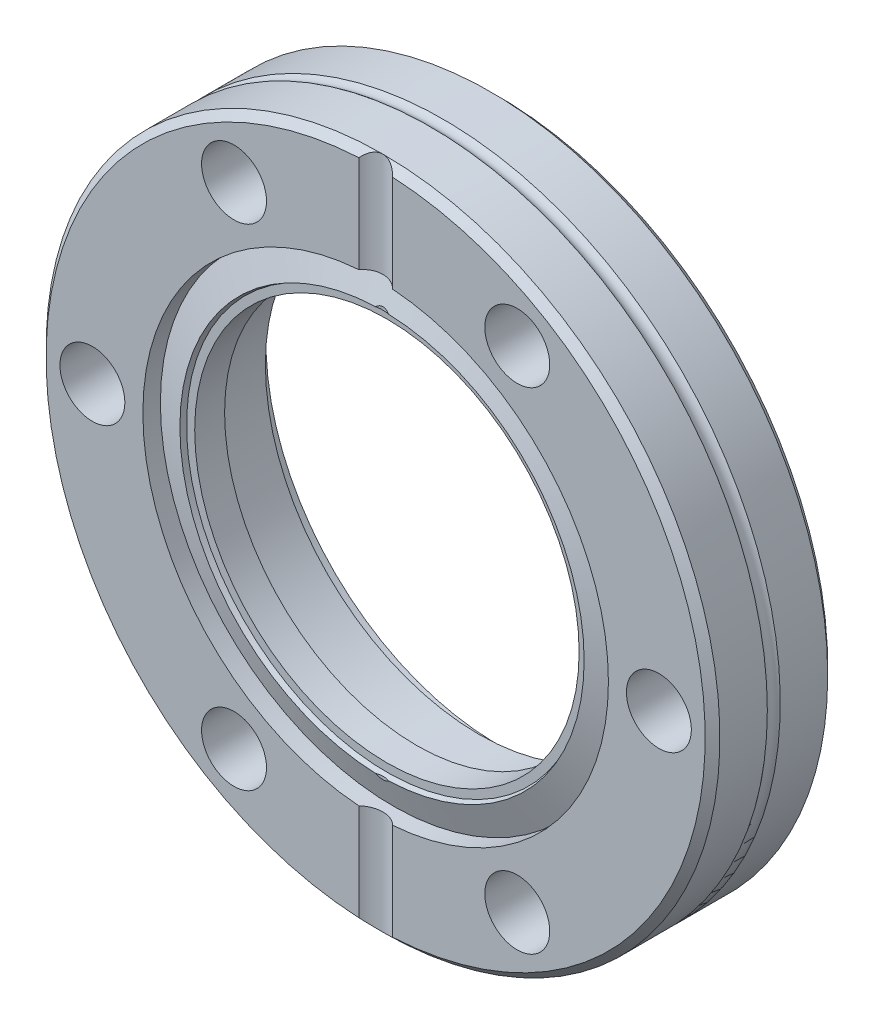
ISO-10303-21;
HEADER;
FILE_DESCRIPTION(('STEP AP214'),'2;1');
FILE_NAME('part.step','',(''),(''),'','','');
FILE_SCHEMA(('AUTOMOTIVE_DESIGN { 1 0 10303 214 1 1 1 1 }'));
ENDSEC;
DATA;
#1=APPLICATION_CONTEXT('core data for automotive mechanical design processes');
#2=APPLICATION_PROTOCOL_DEFINITION('international standard','automotive_design',2000,#1);
#3=PRODUCT_CONTEXT('',#1,'mechanical');
#4=PRODUCT('Part','Part','',(#3));
#5=PRODUCT_RELATED_PRODUCT_CATEGORY('part','',(#4));
#6=PRODUCT_DEFINITION_FORMATION('','',#4);
#7=PRODUCT_DEFINITION_CONTEXT('part definition',#1,'design');
#8=PRODUCT_DEFINITION('design','',#6,#7);
#9=PRODUCT_DEFINITION_SHAPE('','',#8);
#10=(LENGTH_UNIT() NAMED_UNIT(*) SI_UNIT(.MILLI.,.METRE.));
#11=(NAMED_UNIT(*) PLANE_ANGLE_UNIT() SI_UNIT($,.RADIAN.));
#12=(NAMED_UNIT(*) SI_UNIT($,.STERADIAN.) SOLID_ANGLE_UNIT());
#13=UNCERTAINTY_MEASURE_WITH_UNIT(LENGTH_MEASURE(1.E-05),#10,'distance_accuracy_value','');
#14=(GEOMETRIC_REPRESENTATION_CONTEXT(3) GLOBAL_UNCERTAINTY_ASSIGNED_CONTEXT((#13)) GLOBAL_UNIT_ASSIGNED_CONTEXT((#10,
#11,#12)) REPRESENTATION_CONTEXT('',''));
#15=CARTESIAN_POINT('',(0.,0.,0.));
#16=DIRECTION('',(0.,0.,1.));
#17=DIRECTION('',(1.,0.,0.));
#18=AXIS2_PLACEMENT_3D('',#15,#16,#17);
#19=CARTESIAN_POINT('',(0.,0.,11.5316));
#20=DIRECTION('',(0.,0.,1.));
#21=DIRECTION('',(1.,0.,0.));
#22=AXIS2_PLACEMENT_3D('',#19,#20,#21);
#23=PLANE('',#22);
#24=CARTESIAN_POINT('',(0.,0.,11.5316));
#25=DIRECTION('',(0.,0.,1.));
#26=DIRECTION('',(1.,0.,0.));
#27=AXIS2_PLACEMENT_3D('',#24,#25,#26);
#28=CIRCLE('',#27,20.7701031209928);
#29=CARTESIAN_POINT('',(20.7701031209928,0.,11.5316));
#30=VERTEX_POINT('',#29);
#31=EDGE_CURVE('E83',#30,#30,#28,.T.);
#32=ORIENTED_EDGE('',*,*,#31,.T.);
#33=EDGE_LOOP('',(#32));
#34=FACE_BOUND('',#33,.T.);
#35=CARTESIAN_POINT('',(0.,0.,11.5316));
#36=DIRECTION('',(0.,0.,1.));
#37=DIRECTION('',(1.,0.,0.));
#38=AXIS2_PLACEMENT_3D('',#35,#36,#37);
#39=CIRCLE('',#38,19.9263);
#40=CARTESIAN_POINT('',(19.9263,0.,11.5316));
#41=VERTEX_POINT('',#40);
#42=EDGE_CURVE('E23',#41,#41,#39,.F.);
#43=ORIENTED_EDGE('',*,*,#42,.T.);
#44=EDGE_LOOP('',(#43));
#45=FACE_BOUND('',#44,.T.);
#46=ADVANCED_FACE('F19',(#34,#45),#23,.T.);
#47=CARTESIAN_POINT('',(0.,0.,101.848632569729));
#48=DIRECTION('',(0.,0.,1.));
#49=DIRECTION('',(1.,0.,0.));
#50=AXIS2_PLACEMENT_3D('',#47,#48,#49);
#51=CYLINDRICAL_SURFACE('',#50,19.9263);
#52=ORIENTED_EDGE('',*,*,#42,.F.);
#53=EDGE_LOOP('',(#52));
#54=FACE_BOUND('',#53,.T.);
#55=CARTESIAN_POINT('',(0.,0.,8.4328));
#56=DIRECTION('',(0.,0.,1.));
#57=DIRECTION('',(1.,0.,0.));
#58=AXIS2_PLACEMENT_3D('',#55,#56,#57);
#59=CIRCLE('',#58,19.9263);
#60=CARTESIAN_POINT('',(19.9263,0.,8.4328));
#61=VERTEX_POINT('',#60);
#62=EDGE_CURVE('E87',#61,#61,#59,.F.);
#63=ORIENTED_EDGE('',*,*,#62,.T.);
#64=EDGE_LOOP('',(#63));
#65=FACE_BOUND('',#64,.T.);
#66=ADVANCED_FACE('F444',(#54,#65),#51,.F.);
#67=CARTESIAN_POINT('',(0.,-275.59,14.32052));
#68=DIRECTION('',(0.,-1.,0.));
#69=DIRECTION('',(0.,0.,-1.));
#70=AXIS2_PLACEMENT_3D('',#67,#68,#69);
#71=CYLINDRICAL_SURFACE('',#70,2.38125);
#72=CARTESIAN_POINT('',(0.683926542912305,-20.943836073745,12.0396));
#73=CARTESIAN_POINT('',(0.628023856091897,-20.939558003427,12.0228364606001));
#74=CARTESIAN_POINT('',(0.571484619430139,-20.9358233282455,12.0081255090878));
#75=CARTESIAN_POINT('',(0.457421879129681,-20.9294373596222,11.9828867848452));
#76=CARTESIAN_POINT('',(0.399898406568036,-20.9267860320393,11.9723588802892));
#77=CARTESIAN_POINT('',(0.228907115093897,-20.920547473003,11.9475466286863));
#78=CARTESIAN_POINT('',(0.114453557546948,-20.9184828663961,11.93927));
#79=CARTESIAN_POINT('',(-0.114453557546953,-20.9184828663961,11.93927));
#80=CARTESIAN_POINT('',(-0.228907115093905,-20.920547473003,11.9475466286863));
#81=CARTESIAN_POINT('',(-0.399898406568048,-20.9267860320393,11.9723588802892));
#82=CARTESIAN_POINT('',(-0.457421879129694,-20.9294373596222,11.9828867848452));
#83=CARTESIAN_POINT('',(-0.571484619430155,-20.9358233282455,12.0081255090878));
#84=CARTESIAN_POINT('',(-0.628023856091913,-20.939558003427,12.0228364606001));
#85=CARTESIAN_POINT('',(-0.683926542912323,-20.943836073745,12.0396));
#86=B_SPLINE_CURVE_WITH_KNOTS('',3,(#72,#73,#74,#75,#76,#77,#78,#79,#80,#81,#82,#83,#84,#85),
.UNSPECIFIED.,.F.,.F.,(4,2,2,2,2,2,4),(0.,0.1754746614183,0.35094379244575,0.693915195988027,
1.03688659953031,1.21235573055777,1.38783039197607),.UNSPECIFIED.);
#87=CARTESIAN_POINT('',(0.683926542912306,-20.943836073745,12.0396));
#88=VERTEX_POINT('',#87);
#89=CARTESIAN_POINT('',(-0.68392654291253,-20.9438360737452,12.0395999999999));
#90=VERTEX_POINT('',#89);
#91=EDGE_CURVE('E76',#88,#90,#86,.T.);
#92=ORIENTED_EDGE('',*,*,#91,.T.);
#93=CARTESIAN_POINT('',(0.683926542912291,-20.943836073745,12.0396));
#94=CARTESIAN_POINT('',(0.640692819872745,-20.9808495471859,12.0266484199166));
#95=CARTESIAN_POINT('',(0.595267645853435,-21.0159808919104,12.0143571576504));
#96=CARTESIAN_POINT('',(0.499356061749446,-21.0807898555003,11.9916848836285));
#97=CARTESIAN_POINT('',(0.448809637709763,-21.1103875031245,11.9813318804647));
#98=CARTESIAN_POINT('',(0.351405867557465,-21.1573400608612,11.9649094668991));
#99=CARTESIAN_POINT('',(0.3052083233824,-21.175885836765,11.9584233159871));
#100=CARTESIAN_POINT('',(0.210389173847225,-21.2053793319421,11.9481087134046));
#101=CARTESIAN_POINT('',(0.1617850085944,-21.2163750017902,11.9442634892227));
#102=CARTESIAN_POINT('',(0.0939429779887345,-21.2255644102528,11.9410499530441));
#103=CARTESIAN_POINT('',(0.0752230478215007,-21.2274674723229,11.9403844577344));
#104=CARTESIAN_POINT('',(0.0376720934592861,-21.2300143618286,11.9394938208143));
#105=CARTESIAN_POINT('',(0.0188409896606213,-21.2306571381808,11.9392690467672));
#106=CARTESIAN_POINT('',(-0.0476785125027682,-21.2306475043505,11.9392724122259));
#107=CARTESIAN_POINT('',(-0.0954203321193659,-21.2265069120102,11.9407203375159));
#108=CARTESIAN_POINT('',(-0.18943115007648,-21.2104200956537,11.9463459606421));
#109=CARTESIAN_POINT('',(-0.235696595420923,-21.19845634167,11.9505297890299));
#110=CARTESIAN_POINT('',(-0.338159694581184,-21.1636764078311,11.9626933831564));
#111=CARTESIAN_POINT('',(-0.393552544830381,-21.1387704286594,11.9714041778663));
#112=CARTESIAN_POINT('',(-0.499412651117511,-21.0810328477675,11.9915999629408));
#113=CARTESIAN_POINT('',(-0.549871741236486,-21.0481884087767,12.0030894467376));
#114=CARTESIAN_POINT('',(-0.627498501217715,-20.9906039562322,12.0232359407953));
#115=CARTESIAN_POINT('',(-0.656144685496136,-20.967622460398,12.0312768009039));
#116=CARTESIAN_POINT('',(-0.683926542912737,-20.9438360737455,12.0395999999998));
#117=B_SPLINE_CURVE_WITH_KNOTS('',3,(#93,#94,#95,#96,#97,#98,#99,#100,#101,#102,#103,#104,#105,
#106,#107,#108,#109,#110,#111,#112,#113,#114,#115,#116),.UNSPECIFIED.,.F.,.F.,(4,2,2,2,2,2,2,2,
2,2,2,4),(0.,0.175480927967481,0.35332929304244,0.503356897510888,0.652422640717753,
0.708867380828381,0.765359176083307,0.908315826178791,1.05159391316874,1.23461585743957,
1.41793577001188,1.53056719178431),.UNSPECIFIED.);
#118=EDGE_CURVE('E84',#88,#90,#117,.T.);
#119=ORIENTED_EDGE('',*,*,#118,.F.);
#120=EDGE_LOOP('',(#92,#119));
#121=FACE_BOUND('',#120,.T.);
#122=ADVANCED_FACE('F85',(#121),#71,.F.);
#123=CARTESIAN_POINT('',(0.,0.,12.0396));
#124=DIRECTION('',(0.,0.,1.));
#125=DIRECTION('',(1.,0.,0.));
#126=AXIS2_PLACEMENT_3D('',#123,#124,#125);
#127=CONICAL_SURFACE('',#126,20.955,0.349065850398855);
#128=ORIENTED_EDGE('',*,*,#91,.F.);
#129=CARTESIAN_POINT('',(0.,0.,12.0396));
#130=DIRECTION('',(0.,0.,-1.));
#131=DIRECTION('',(-1.,0.,0.));
#132=AXIS2_PLACEMENT_3D('',#129,#130,#131);
#133=CIRCLE('',#132,20.955);
#134=CARTESIAN_POINT('',(0.683926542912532,20.9438360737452,12.0395999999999));
#135=VERTEX_POINT('',#134);
#136=EDGE_CURVE('E81',#135,#88,#133,.T.);
#137=ORIENTED_EDGE('',*,*,#136,.F.);
#138=CARTESIAN_POINT('',(0.683926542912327,20.943836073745,12.0396));
#139=CARTESIAN_POINT('',(0.628023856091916,20.939558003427,12.0228364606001));
#140=CARTESIAN_POINT('',(0.571484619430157,20.9358233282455,12.0081255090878));
#141=CARTESIAN_POINT('',(0.457421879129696,20.9294373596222,11.9828867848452));
#142=CARTESIAN_POINT('',(0.39989840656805,20.9267860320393,11.9723588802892));
#143=CARTESIAN_POINT('',(0.228907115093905,20.920547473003,11.9475466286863));
#144=CARTESIAN_POINT('',(0.114453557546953,20.9184828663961,11.93927));
#145=CARTESIAN_POINT('',(-0.114453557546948,20.9184828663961,11.93927));
#146=CARTESIAN_POINT('',(-0.228907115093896,20.920547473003,11.9475466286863));
#147=CARTESIAN_POINT('',(-0.399898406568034,20.9267860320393,11.9723588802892));
#148=CARTESIAN_POINT('',(-0.457421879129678,20.9294373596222,11.9828867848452));
#149=CARTESIAN_POINT('',(-0.571484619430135,20.9358233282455,12.0081255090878));
#150=CARTESIAN_POINT('',(-0.628023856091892,20.939558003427,12.0228364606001));
#151=CARTESIAN_POINT('',(-0.6839265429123,20.943836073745,12.0396));
#152=B_SPLINE_CURVE_WITH_KNOTS('',3,(#138,#139,#140,#141,#142,#143,#144,#145,#146,#147,#148,
#149,#150,#151),.UNSPECIFIED.,.F.,.F.,(4,2,2,2,2,2,4),(0.,0.175474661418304,0.35094379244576,
0.693915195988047,1.03688659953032,1.21235573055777,1.38783039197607),.UNSPECIFIED.);
#153=CARTESIAN_POINT('',(-0.683926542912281,20.943836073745,12.0396));
#154=VERTEX_POINT('',#153);
#155=EDGE_CURVE('E476',#135,#154,#152,.T.);
#156=ORIENTED_EDGE('',*,*,#155,.T.);
#157=CARTESIAN_POINT('',(0.,0.,12.0396));
#158=DIRECTION('',(0.,0.,-1.));
#159=DIRECTION('',(-1.,0.,0.));
#160=AXIS2_PLACEMENT_3D('',#157,#158,#159);
#161=CIRCLE('',#160,20.9550000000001);
#162=EDGE_CURVE('E72',#90,#154,#161,.T.);
#163=ORIENTED_EDGE('',*,*,#162,.F.);
#164=EDGE_LOOP('',(#128,#137,#156,#163));
#165=FACE_BOUND('',#164,.T.);
#166=ORIENTED_EDGE('',*,*,#31,.F.);
#167=EDGE_LOOP('',(#166));
#168=FACE_BOUND('',#167,.T.);
#169=ADVANCED_FACE('F78',(#165,#168),#127,.F.);
#170=CARTESIAN_POINT('',(0.,-275.59,14.32052));
#171=DIRECTION('',(0.,-1.,0.));
#172=DIRECTION('',(0.,0.,-1.));
#173=AXIS2_PLACEMENT_3D('',#170,#171,#172);
#174=CYLINDRICAL_SURFACE('',#173,2.38125);
#175=CARTESIAN_POINT('',(-0.683926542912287,20.943836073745,12.0396));
#176=CARTESIAN_POINT('',(-0.64069281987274,20.9808495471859,12.0266484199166));
#177=CARTESIAN_POINT('',(-0.595267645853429,21.0159808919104,12.0143571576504));
#178=CARTESIAN_POINT('',(-0.49935606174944,21.0807898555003,11.9916848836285));
#179=CARTESIAN_POINT('',(-0.448809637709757,21.1103875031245,11.9813318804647));
#180=CARTESIAN_POINT('',(-0.35140586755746,21.1573400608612,11.9649094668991));
#181=CARTESIAN_POINT('',(-0.305208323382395,21.175885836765,11.9584233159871));
#182=CARTESIAN_POINT('',(-0.21038917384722,21.2053793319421,11.9481087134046));
#183=CARTESIAN_POINT('',(-0.161785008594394,21.2163750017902,11.9442634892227));
#184=CARTESIAN_POINT('',(-0.09394297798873,21.2255644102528,11.9410499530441));
#185=CARTESIAN_POINT('',(-0.075223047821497,21.2274674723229,11.9403844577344));
#186=CARTESIAN_POINT('',(-0.037672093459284,21.2300143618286,11.9394938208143));
#187=CARTESIAN_POINT('',(-0.0188409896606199,21.2306571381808,11.9392690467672));
#188=CARTESIAN_POINT('',(0.0476785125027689,21.2306475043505,11.9392724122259));
#189=CARTESIAN_POINT('',(0.0954203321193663,21.2265069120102,11.9407203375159));
#190=CARTESIAN_POINT('',(0.189431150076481,21.2104200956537,11.9463459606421));
#191=CARTESIAN_POINT('',(0.235696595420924,21.19845634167,11.9505297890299));
#192=CARTESIAN_POINT('',(0.338159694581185,21.1636764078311,11.9626933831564));
#193=CARTESIAN_POINT('',(0.393552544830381,21.1387704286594,11.9714041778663));
#194=CARTESIAN_POINT('',(0.499412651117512,21.0810328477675,11.9915999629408));
#195=CARTESIAN_POINT('',(0.549871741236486,21.0481884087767,12.0030894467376));
#196=CARTESIAN_POINT('',(0.627498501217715,20.9906039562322,12.0232359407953));
#197=CARTESIAN_POINT('',(0.656144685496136,20.967622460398,12.0312768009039));
#198=CARTESIAN_POINT('',(0.683926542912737,20.9438360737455,12.0395999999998));
#199=B_SPLINE_CURVE_WITH_KNOTS('',3,(#175,#176,#177,#178,#179,#180,#181,#182,#183,#184,#185,
#186,#187,#188,#189,#190,#191,#192,#193,#194,#195,#196,#197,#198),.UNSPECIFIED.,.F.,.F.,(4,2,2,
2,2,2,2,2,2,2,2,4),(0.,0.175480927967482,0.353329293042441,0.503356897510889,0.652422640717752,
0.708867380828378,0.765359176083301,0.908315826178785,1.05159391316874,1.23461585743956,
1.41793577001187,1.5305671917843),.UNSPECIFIED.);
#200=EDGE_CURVE('E92',#154,#135,#199,.T.);
#201=ORIENTED_EDGE('',*,*,#200,.F.);
#202=ORIENTED_EDGE('',*,*,#155,.F.);
#203=EDGE_LOOP('',(#201,#202));
#204=FACE_BOUND('',#203,.T.);
#205=ADVANCED_FACE('F234',(#204),#174,.F.);
#206=CARTESIAN_POINT('',(0.,0.,8.4328));
#207=DIRECTION('',(0.,0.,1.));
#208=DIRECTION('',(1.,0.,0.));
#209=AXIS2_PLACEMENT_3D('',#206,#207,#208);
#210=PLANE('',#209);
#211=ORIENTED_EDGE('',*,*,#62,.F.);
#212=EDGE_LOOP('',(#211));
#213=FACE_BOUND('',#212,.T.);
#214=CARTESIAN_POINT('',(0.,0.,8.4328));
#215=DIRECTION('',(0.,0.,1.));
#216=DIRECTION('',(1.,0.,0.));
#217=AXIS2_PLACEMENT_3D('',#214,#215,#216);
#218=CIRCLE('',#217,22.1488);
#219=CARTESIAN_POINT('',(22.1488,0.,8.4328));
#220=VERTEX_POINT('',#219);
#221=EDGE_CURVE('E221',#220,#220,#218,.F.);
#222=ORIENTED_EDGE('',*,*,#221,.T.);
#223=EDGE_LOOP('',(#222));
#224=FACE_BOUND('',#223,.T.);
#225=ADVANCED_FACE('F246',(#213,#224),#210,.F.);
#226=CARTESIAN_POINT('',(0.,0.,137.16));
#227=DIRECTION('',(0.,0.,-1.));
#228=DIRECTION('',(-1.,0.,0.));
#229=AXIS2_PLACEMENT_3D('',#226,#227,#228);
#230=CYLINDRICAL_SURFACE('',#229,34.925);
#231=CARTESIAN_POINT('',(0.,0.,7.0220208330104));
#232=DIRECTION('',(0.,0.,1.));
#233=DIRECTION('',(1.,0.,0.));
#234=AXIS2_PLACEMENT_3D('',#231,#232,#233);
#235=CIRCLE('',#234,34.925);
#236=CARTESIAN_POINT('',(34.925,0.,7.0220208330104));
#237=VERTEX_POINT('',#236);
#238=EDGE_CURVE('E97',#237,#237,#235,.T.);
#239=ORIENTED_EDGE('',*,*,#238,.T.);
#240=EDGE_LOOP('',(#239));
#241=FACE_BOUND('',#240,.T.);
#242=CARTESIAN_POINT('',(0.,0.,11.938));
#243=DIRECTION('',(0.,0.,-1.));
#244=DIRECTION('',(0.,1.,0.));
#245=AXIS2_PLACEMENT_3D('',#242,#243,#244);
#246=CIRCLE('',#245,34.925);
#247=CARTESIAN_POINT('',(0.,-34.924365,11.938635));
#248=VERTEX_POINT('',#247);
#249=CARTESIAN_POINT('',(0.,34.924365,11.938635));
#250=VERTEX_POINT('',#249);
#251=EDGE_CURVE('E206',#248,#250,#246,.F.);
#252=ORIENTED_EDGE('',*,*,#251,.F.);
#253=CARTESIAN_POINT('',(0.,0.,11.938));
#254=DIRECTION('',(0.,0.,-1.));
#255=DIRECTION('',(0.,1.,0.));
#256=AXIS2_PLACEMENT_3D('',#253,#254,#255);
#257=CIRCLE('',#256,34.925);
#258=EDGE_CURVE('E215',#250,#248,#257,.F.);
#259=ORIENTED_EDGE('',*,*,#258,.F.);
#260=EDGE_LOOP('',(#252,#259));
#261=FACE_BOUND('',#260,.T.);
#262=ADVANCED_FACE('F242',(#241,#261),#230,.T.);
#263=CARTESIAN_POINT('',(0.,0.,10.8839945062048));
#264=DIRECTION('',(0.,0.,-1.));
#265=DIRECTION('',(-1.,0.,0.));
#266=AXIS2_PLACEMENT_3D('',#263,#264,#265);
#267=CONICAL_SURFACE('',#266,24.13,1.22173047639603);
#268=CARTESIAN_POINT('',(0.,0.,10.8839945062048));
#269=DIRECTION('',(0.,0.,-1.));
#270=DIRECTION('',(-1.,0.,0.));
#271=AXIS2_PLACEMENT_3D('',#268,#269,#270);
#272=CIRCLE('',#271,24.13);
#273=CARTESIAN_POINT('',(-24.13,0.,10.8839945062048));
#274=VERTEX_POINT('',#273);
#275=EDGE_CURVE('E345',#274,#274,#272,.F.);
#276=ORIENTED_EDGE('',*,*,#275,.T.);
#277=EDGE_LOOP('',(#276));
#278=FACE_BOUND('',#277,.T.);
#279=ORIENTED_EDGE('',*,*,#162,.T.);
#280=ORIENTED_EDGE('',*,*,#200,.T.);
#281=ORIENTED_EDGE('',*,*,#136,.T.);
#282=ORIENTED_EDGE('',*,*,#118,.T.);
#283=EDGE_LOOP('',(#279,#280,#281,#282));
#284=FACE_BOUND('',#283,.T.);
#285=ADVANCED_FACE('F90',(#278,#284),#267,.T.);
#286=CARTESIAN_POINT('',(0.,0.,8.4328));
#287=DIRECTION('',(0.,0.,1.));
#288=DIRECTION('',(1.,0.,0.));
#289=AXIS2_PLACEMENT_3D('',#286,#287,#288);
#290=CYLINDRICAL_SURFACE('',#289,22.1488);
#291=ORIENTED_EDGE('',*,*,#221,.F.);
#292=EDGE_LOOP('',(#291));
#293=FACE_BOUND('',#292,.T.);
#294=CARTESIAN_POINT('',(0.,0.,1.9812));
#295=DIRECTION('',(0.,0.,1.));
#296=DIRECTION('',(1.,0.,0.));
#297=AXIS2_PLACEMENT_3D('',#294,#295,#296);
#298=CIRCLE('',#297,22.1488);
#299=CARTESIAN_POINT('',(22.1488,0.,1.9812));
#300=VERTEX_POINT('',#299);
#301=EDGE_CURVE('E162',#300,#300,#298,.F.);
#302=ORIENTED_EDGE('',*,*,#301,.T.);
#303=EDGE_LOOP('',(#302));
#304=FACE_BOUND('',#303,.T.);
#305=ADVANCED_FACE('F241',(#293,#304),#290,.F.);
#306=CARTESIAN_POINT('',(0.,0.,6.34999999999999));
#307=DIRECTION('',(0.,0.,1.));
#308=DIRECTION('',(0.,-1.,0.));
#309=AXIS2_PLACEMENT_3D('',#306,#307,#308);
#310=TOROIDAL_SURFACE('',#309,35.687,1.016);
#311=ORIENTED_EDGE('',*,*,#238,.F.);
#312=EDGE_LOOP('',(#311));
#313=FACE_BOUND('',#312,.T.);
#314=CARTESIAN_POINT('',(0.,0.,5.67797916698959));
#315=DIRECTION('',(0.,0.,-1.));
#316=DIRECTION('',(-1.,0.,0.));
#317=AXIS2_PLACEMENT_3D('',#314,#315,#316);
#318=CIRCLE('',#317,34.925);
#319=CARTESIAN_POINT('',(-34.925,0.,5.67797916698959));
#320=VERTEX_POINT('',#319);
#321=EDGE_CURVE('E161',#320,#320,#318,.T.);
#322=ORIENTED_EDGE('',*,*,#321,.F.);
#323=EDGE_LOOP('',(#322));
#324=FACE_BOUND('',#323,.T.);
#325=ADVANCED_FACE('F21',(#313,#324),#310,.F.);
#326=CARTESIAN_POINT('',(0.,0.,11.938));
#327=DIRECTION('',(0.,0.,-1.));
#328=DIRECTION('',(-1.,0.,0.));
#329=AXIS2_PLACEMENT_3D('',#326,#327,#328);
#330=CONICAL_SURFACE('',#329,34.925,0.785398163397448);
#331=CARTESIAN_POINT('',(-1.74478264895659,34.1184158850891,12.7));
#332=CARTESIAN_POINT('',(-1.66673719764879,34.2064963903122,12.6160080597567));
#333=CARTESIAN_POINT('',(-1.58040134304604,34.2915257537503,12.5352121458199));
#334=CARTESIAN_POINT('',(-1.38958730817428,34.4522866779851,12.3828481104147));
#335=CARTESIAN_POINT('',(-1.28487391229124,34.52787277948,12.3114236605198));
#336=CARTESIAN_POINT('',(-1.08575554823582,34.6471695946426,12.1989312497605));
#337=CARTESIAN_POINT('',(-0.995131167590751,34.6941500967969,12.154715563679));
#338=CARTESIAN_POINT('',(-0.80518111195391,34.776600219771,12.0772107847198));
#339=CARTESIAN_POINT('',(-0.705928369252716,34.8121562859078,12.0438396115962));
#340=CARTESIAN_POINT('',(-0.555452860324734,34.8541766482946,12.0044308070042));
#341=CARTESIAN_POINT('',(-0.50698422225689,34.8660216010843,11.9933273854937));
#342=CARTESIAN_POINT('',(-0.408797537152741,34.8865498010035,11.9740898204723));
#343=CARTESIAN_POINT('',(-0.359079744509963,34.8952336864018,11.9659550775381));
#344=CARTESIAN_POINT('',(-0.258069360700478,34.9093423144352,11.9527408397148));
#345=CARTESIAN_POINT('',(-0.206764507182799,34.9147204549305,11.9477050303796));
#346=CARTESIAN_POINT('',(-0.103643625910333,34.9219231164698,11.9409615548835));
#347=CARTESIAN_POINT('',(-0.0518271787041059,34.923744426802,11.9392568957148));
#348=CARTESIAN_POINT('',(0.,34.92373,11.93927));
#349=B_SPLINE_CURVE_WITH_KNOTS('',3,(#331,#332,#333,#334,#335,#336,#337,#338,#339,#340,#341,
#342,#343,#344,#345,#346,#347,#348),.UNSPECIFIED.,.F.,.F.,(4,2,2,2,2,2,2,2,4),(0.,
0.434671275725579,0.875376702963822,1.20788676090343,1.53781808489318,1.6910007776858,
1.8441525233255,1.99941654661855,2.15482066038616),.UNSPECIFIED.);
#350=CARTESIAN_POINT('',(-1.74478264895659,34.1184158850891,12.7));
#351=VERTEX_POINT('',#350);
#352=EDGE_CURVE('E207',#351,#250,#349,.T.);
#353=ORIENTED_EDGE('',*,*,#352,.T.);
#354=ORIENTED_EDGE('',*,*,#258,.T.);
#355=CARTESIAN_POINT('',(0.,-34.92373,11.93927));
#356=CARTESIAN_POINT('',(-0.0526404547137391,-34.9237454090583,11.939256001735));
#357=CARTESIAN_POINT('',(-0.105269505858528,-34.9218660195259,11.9410150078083));
#358=CARTESIAN_POINT('',(-0.209992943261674,-34.9144362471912,11.9479711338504));
#359=CARTESIAN_POINT('',(-0.262087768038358,-34.9088891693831,11.9531651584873));
#360=CARTESIAN_POINT('',(-0.364611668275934,-34.8943437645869,11.9667886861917));
#361=CARTESIAN_POINT('',(-0.415053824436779,-34.8853943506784,11.9751723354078));
#362=CARTESIAN_POINT('',(-0.514632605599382,-34.8642467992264,11.9949909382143));
#363=CARTESIAN_POINT('',(-0.563769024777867,-34.8520481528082,12.0064263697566));
#364=CARTESIAN_POINT('',(-0.708388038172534,-34.8110260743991,12.0449010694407));
#365=CARTESIAN_POINT('',(-0.801525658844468,-34.7777102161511,12.0761707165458));
#366=CARTESIAN_POINT('',(-0.980315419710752,-34.7010157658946,12.1482586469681));
#367=CARTESIAN_POINT('',(-1.06590817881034,-34.6575657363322,12.1891447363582));
#368=CARTESIAN_POINT('',(-1.26587192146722,-34.5409670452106,12.2990576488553));
#369=CARTESIAN_POINT('',(-1.37525781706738,-34.4633741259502,12.3723564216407));
#370=CARTESIAN_POINT('',(-1.57418634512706,-34.2976346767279,12.529406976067));
#371=CARTESIAN_POINT('',(-1.66396535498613,-34.2096361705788,12.6130127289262));
#372=CARTESIAN_POINT('',(-1.74478264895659,-34.1184158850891,12.7));
#373=B_SPLINE_CURVE_WITH_KNOTS('',3,(#355,#356,#357,#358,#359,#360,#361,#362,#363,#364,#365,
#366,#367,#368,#369,#370,#371,#372),.UNSPECIFIED.,.F.,.F.,(4,2,2,2,2,2,2,2,4),(0.,
0.157840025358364,0.315538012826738,0.471049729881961,0.626585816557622,0.936313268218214,
1.24829380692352,1.70447981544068,2.15481846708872),.UNSPECIFIED.);
#374=CARTESIAN_POINT('',(-1.74478264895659,-34.1184158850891,12.7));
#375=VERTEX_POINT('',#374);
#376=EDGE_CURVE('E203',#248,#375,#373,.T.);
#377=ORIENTED_EDGE('',*,*,#376,.T.);
#378=CARTESIAN_POINT('',(0.,0.,12.7));
#379=DIRECTION('',(0.,0.,-1.));
#380=DIRECTION('',(-1.,0.,0.));
#381=AXIS2_PLACEMENT_3D('',#378,#379,#380);
#382=CIRCLE('',#381,34.163);
#383=EDGE_CURVE('E158',#375,#351,#382,.T.);
#384=ORIENTED_EDGE('',*,*,#383,.T.);
#385=EDGE_LOOP('',(#353,#354,#377,#384));
#386=FACE_BOUND('',#385,.T.);
#387=ADVANCED_FACE('F189',(#386),#330,.T.);
#388=CARTESIAN_POINT('',(0.,0.,11.938));
#389=DIRECTION('',(0.,0.,-1.));
#390=DIRECTION('',(-1.,0.,0.));
#391=AXIS2_PLACEMENT_3D('',#388,#389,#390);
#392=CONICAL_SURFACE('',#391,34.925,0.785398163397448);
#393=CARTESIAN_POINT('',(0.,34.92373,11.93927));
#394=CARTESIAN_POINT('',(0.0526404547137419,34.9237454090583,11.939256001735));
#395=CARTESIAN_POINT('',(0.105269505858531,34.9218660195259,11.9410150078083));
#396=CARTESIAN_POINT('',(0.209992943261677,34.9144362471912,11.9479711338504));
#397=CARTESIAN_POINT('',(0.262087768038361,34.9088891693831,11.9531651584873));
#398=CARTESIAN_POINT('',(0.364611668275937,34.8943437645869,11.9667886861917));
#399=CARTESIAN_POINT('',(0.415053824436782,34.8853943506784,11.9751723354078));
#400=CARTESIAN_POINT('',(0.514632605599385,34.8642467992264,11.9949909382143));
#401=CARTESIAN_POINT('',(0.56376902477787,34.8520481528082,12.0064263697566));
#402=CARTESIAN_POINT('',(0.708388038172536,34.8110260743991,12.0449010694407));
#403=CARTESIAN_POINT('',(0.80152565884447,34.7777102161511,12.0761707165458));
#404=CARTESIAN_POINT('',(0.980315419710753,34.7010157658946,12.1482586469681));
#405=CARTESIAN_POINT('',(1.06590817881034,34.6575657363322,12.1891447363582));
#406=CARTESIAN_POINT('',(1.26587192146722,34.5409670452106,12.2990576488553));
#407=CARTESIAN_POINT('',(1.37525781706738,34.4633741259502,12.3723564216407));
#408=CARTESIAN_POINT('',(1.57418634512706,34.2976346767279,12.529406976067));
#409=CARTESIAN_POINT('',(1.66396535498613,34.2096361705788,12.6130127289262));
#410=CARTESIAN_POINT('',(1.74478264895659,34.1184158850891,12.7));
#411=B_SPLINE_CURVE_WITH_KNOTS('',3,(#393,#394,#395,#396,#397,#398,#399,#400,#401,#402,#403,
#404,#405,#406,#407,#408,#409,#410),.UNSPECIFIED.,.F.,.F.,(4,2,2,2,2,2,2,2,4),(0.,
0.157840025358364,0.315538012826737,0.471049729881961,0.626585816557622,0.936313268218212,
1.24829380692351,1.70447981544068,2.15481846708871),.UNSPECIFIED.);
#412=CARTESIAN_POINT('',(1.74478264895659,34.1184158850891,12.7));
#413=VERTEX_POINT('',#412);
#414=EDGE_CURVE('E165',#250,#413,#411,.T.);
#415=ORIENTED_EDGE('',*,*,#414,.T.);
#416=CARTESIAN_POINT('',(0.,0.,12.7));
#417=DIRECTION('',(0.,0.,-1.));
#418=DIRECTION('',(-1.,0.,0.));
#419=AXIS2_PLACEMENT_3D('',#416,#417,#418);
#420=CIRCLE('',#419,34.163);
#421=CARTESIAN_POINT('',(1.7447826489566,-34.1184158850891,12.7));
#422=VERTEX_POINT('',#421);
#423=EDGE_CURVE('E150',#413,#422,#420,.T.);
#424=ORIENTED_EDGE('',*,*,#423,.T.);
#425=CARTESIAN_POINT('',(1.74478264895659,-34.1184158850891,12.7));
#426=CARTESIAN_POINT('',(1.66673719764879,-34.2064963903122,12.6160080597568));
#427=CARTESIAN_POINT('',(1.58040134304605,-34.2915257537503,12.5352121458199));
#428=CARTESIAN_POINT('',(1.38958730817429,-34.4522866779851,12.3828481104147));
#429=CARTESIAN_POINT('',(1.28487391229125,-34.52787277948,12.3114236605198));
#430=CARTESIAN_POINT('',(1.08575554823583,-34.6471695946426,12.1989312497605));
#431=CARTESIAN_POINT('',(0.995131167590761,-34.6941500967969,12.154715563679));
#432=CARTESIAN_POINT('',(0.80518111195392,-34.7766002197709,12.0772107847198));
#433=CARTESIAN_POINT('',(0.705928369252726,-34.8121562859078,12.0438396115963));
#434=CARTESIAN_POINT('',(0.555452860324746,-34.8541766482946,12.0044308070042));
#435=CARTESIAN_POINT('',(0.506984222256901,-34.8660216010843,11.9933273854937));
#436=CARTESIAN_POINT('',(0.408797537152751,-34.8865498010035,11.9740898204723));
#437=CARTESIAN_POINT('',(0.359079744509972,-34.8952336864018,11.9659550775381));
#438=CARTESIAN_POINT('',(0.258069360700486,-34.9093423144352,11.9527408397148));
#439=CARTESIAN_POINT('',(0.206764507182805,-34.9147204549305,11.9477050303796));
#440=CARTESIAN_POINT('',(0.103643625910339,-34.9219231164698,11.9409615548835));
#441=CARTESIAN_POINT('',(0.0518271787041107,-34.923744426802,11.9392568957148));
#442=CARTESIAN_POINT('',(0.,-34.92373,11.93927));
#443=B_SPLINE_CURVE_WITH_KNOTS('',3,(#425,#426,#427,#428,#429,#430,#431,#432,#433,#434,#435,
#436,#437,#438,#439,#440,#441,#442),.UNSPECIFIED.,.F.,.F.,(4,2,2,2,2,2,2,2,4),(0.,
0.434671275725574,0.875376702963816,1.20788676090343,1.53781808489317,1.69100077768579,
1.84415252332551,1.99941654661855,2.15482066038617),.UNSPECIFIED.);
#444=EDGE_CURVE('E202',#422,#248,#443,.T.);
#445=ORIENTED_EDGE('',*,*,#444,.T.);
#446=ORIENTED_EDGE('',*,*,#251,.T.);
#447=EDGE_LOOP('',(#415,#424,#445,#446));
#448=FACE_BOUND('',#447,.T.);
#449=ADVANCED_FACE('F183',(#448),#392,.T.);
#450=CARTESIAN_POINT('',(0.,-275.59,14.32052));
#451=DIRECTION('',(0.,-1.,0.));
#452=DIRECTION('',(0.,0.,-1.));
#453=AXIS2_PLACEMENT_3D('',#450,#451,#452);
#454=CYLINDRICAL_SURFACE('',#453,2.38125);
#455=DIRECTION('',(0.,1.,0.));
#456=VECTOR('',#455,1.);
#457=CARTESIAN_POINT('',(1.7447826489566,0.,12.7));
#458=LINE('',#457,#456);
#459=CARTESIAN_POINT('',(1.7447826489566,-24.0668367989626,12.7));
#460=VERTEX_POINT('',#459);
#461=EDGE_CURVE('E149',#422,#460,#458,.T.);
#462=ORIENTED_EDGE('',*,*,#461,.T.);
#463=CARTESIAN_POINT('',(1.7447826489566,-24.0668367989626,12.7));
#464=CARTESIAN_POINT('',(1.69927324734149,-24.0701366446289,12.650991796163));
#465=CARTESIAN_POINT('',(1.65169287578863,-24.0734558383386,12.6039122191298));
#466=CARTESIAN_POINT('',(1.55274099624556,-24.0800404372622,12.5139176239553));
#467=CARTESIAN_POINT('',(1.50136949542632,-24.0833058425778,12.4710025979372));
#468=CARTESIAN_POINT('',(1.39511883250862,-24.0896944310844,12.3895927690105));
#469=CARTESIAN_POINT('',(1.34023531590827,-24.0928174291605,12.3511036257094));
#470=CARTESIAN_POINT('',(1.22742968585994,-24.0988280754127,12.2788887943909));
#471=CARTESIAN_POINT('',(1.16950771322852,-24.1017157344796,12.2451628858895));
#472=CARTESIAN_POINT('',(0.991692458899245,-24.1099039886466,12.151459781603));
#473=CARTESIAN_POINT('',(0.867736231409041,-24.1147307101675,12.0989467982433));
#474=CARTESIAN_POINT('',(0.613001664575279,-24.1225475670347,12.0156352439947));
#475=CARTESIAN_POINT('',(0.482240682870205,-24.1255421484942,11.9847840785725));
#476=CARTESIAN_POINT('',(0.292030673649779,-24.1283029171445,11.9565175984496));
#477=CARTESIAN_POINT('',(0.233827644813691,-24.1289375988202,11.9500558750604));
#478=CARTESIAN_POINT('',(0.117092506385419,-24.1297865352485,11.941430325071));
#479=CARTESIAN_POINT('',(0.0585603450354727,-24.1300007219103,11.9392671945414));
#480=CARTESIAN_POINT('',(-0.133321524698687,-24.1299983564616,11.9392763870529));
#481=CARTESIAN_POINT('',(-0.266789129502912,-24.1288828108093,11.9505091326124));
#482=CARTESIAN_POINT('',(-0.5301044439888,-24.1245373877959,11.9951749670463));
#483=CARTESIAN_POINT('',(-0.659944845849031,-24.1213035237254,12.0286499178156));
#484=CARTESIAN_POINT('',(-0.912089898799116,-24.1130857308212,12.1168241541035));
#485=CARTESIAN_POINT('',(-1.0343973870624,-24.1081024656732,12.1715153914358));
#486=CARTESIAN_POINT('',(-1.26797009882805,-24.0969460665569,12.3005306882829));
#487=CARTESIAN_POINT('',(-1.37925078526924,-24.0907746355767,12.3748267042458));
#488=CARTESIAN_POINT('',(-1.52999264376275,-24.0814911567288,12.4948609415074));
#489=CARTESIAN_POINT('',(-1.57513364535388,-24.0785749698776,12.5336652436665));
#490=CARTESIAN_POINT('',(-1.66230993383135,-24.0727132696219,12.6144726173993));
#491=CARTESIAN_POINT('',(-1.70435039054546,-24.069767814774,12.6564701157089));
#492=CARTESIAN_POINT('',(-1.7447826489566,-24.0668367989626,12.7));
#493=B_SPLINE_CURVE_WITH_KNOTS('',3,(#463,#464,#465,#466,#467,#468,#469,#470,#471,#472,#473,
#474,#475,#476,#477,#478,#479,#480,#481,#482,#483,#484,#485,#486,#487,#488,#489,#490,#491,#492),
.UNSPECIFIED.,.F.,.F.,(4,2,2,2,2,2,2,2,2,2,2,2,2,2,4),(0.,0.200818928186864,0.401637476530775,
0.602710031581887,0.803773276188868,1.20584895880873,1.60694500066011,1.78250190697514,
1.95808723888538,2.35783393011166,2.75833512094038,3.15868453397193,3.55846434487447,
3.73712126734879,3.91547322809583),.UNSPECIFIED.);
#494=CARTESIAN_POINT('',(-1.7447826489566,-24.0668367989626,12.7));
#495=VERTEX_POINT('',#494);
#496=EDGE_CURVE('E348',#460,#495,#493,.T.);
#497=ORIENTED_EDGE('',*,*,#496,.T.);
#498=DIRECTION('',(0.,1.,0.));
#499=VECTOR('',#498,1.);
#500=CARTESIAN_POINT('',(-1.7447826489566,0.,12.7));
#501=LINE('',#500,#499);
#502=EDGE_CURVE('E153',#495,#375,#501,.F.);
#503=ORIENTED_EDGE('',*,*,#502,.T.);
#504=ORIENTED_EDGE('',*,*,#376,.F.);
#505=ORIENTED_EDGE('',*,*,#444,.F.);
#506=EDGE_LOOP('',(#462,#497,#503,#504,#505));
#507=FACE_BOUND('',#506,.T.);
#508=ADVANCED_FACE('F188',(#507),#454,.F.);
#509=CARTESIAN_POINT('',(0.,0.,137.16));
#510=DIRECTION('',(0.,0.,-1.));
#511=DIRECTION('',(-1.,0.,0.));
#512=AXIS2_PLACEMENT_3D('',#509,#510,#511);
#513=CYLINDRICAL_SURFACE('',#512,24.13);
#514=CARTESIAN_POINT('',(1.7447826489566,24.0668367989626,12.7));
#515=CARTESIAN_POINT('',(1.69927324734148,24.0701366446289,12.650991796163));
#516=CARTESIAN_POINT('',(1.65169287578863,24.0734558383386,12.6039122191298));
#517=CARTESIAN_POINT('',(1.55274099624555,24.0800404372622,12.5139176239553));
#518=CARTESIAN_POINT('',(1.50136949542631,24.0833058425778,12.4710025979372));
#519=CARTESIAN_POINT('',(1.39511883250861,24.0896944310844,12.3895927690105));
#520=CARTESIAN_POINT('',(1.34023531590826,24.0928174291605,12.3511036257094));
#521=CARTESIAN_POINT('',(1.22742968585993,24.0988280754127,12.2788887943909));
#522=CARTESIAN_POINT('',(1.16950771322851,24.1017157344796,12.2451628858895));
#523=CARTESIAN_POINT('',(0.99169245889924,24.1099039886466,12.151459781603));
#524=CARTESIAN_POINT('',(0.867736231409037,24.1147307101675,12.0989467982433));
#525=CARTESIAN_POINT('',(0.613001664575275,24.1225475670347,12.0156352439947));
#526=CARTESIAN_POINT('',(0.4822406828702,24.1255421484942,11.9847840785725));
#527=CARTESIAN_POINT('',(0.292030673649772,24.1283029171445,11.9565175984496));
#528=CARTESIAN_POINT('',(0.233827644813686,24.1289375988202,11.9500558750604));
#529=CARTESIAN_POINT('',(0.117092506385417,24.1297865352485,11.941430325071));
#530=CARTESIAN_POINT('',(0.0585603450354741,24.1300007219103,11.9392671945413));
#531=CARTESIAN_POINT('',(-0.13332152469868,24.1299983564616,11.9392763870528));
#532=CARTESIAN_POINT('',(-0.266789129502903,24.1288828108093,11.9505091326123));
#533=CARTESIAN_POINT('',(-0.530104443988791,24.1245373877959,11.9951749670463));
#534=CARTESIAN_POINT('',(-0.659944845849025,24.1213035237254,12.0286499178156));
#535=CARTESIAN_POINT('',(-0.912089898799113,24.1130857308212,12.1168241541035));
#536=CARTESIAN_POINT('',(-1.0343973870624,24.1081024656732,12.1715153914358));
#537=CARTESIAN_POINT('',(-1.26797009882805,24.0969460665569,12.3005306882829));
#538=CARTESIAN_POINT('',(-1.37925078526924,24.0907746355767,12.3748267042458));
#539=CARTESIAN_POINT('',(-1.52999264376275,24.0814911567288,12.4948609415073));
#540=CARTESIAN_POINT('',(-1.57513364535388,24.0785749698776,12.5336652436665));
#541=CARTESIAN_POINT('',(-1.66230993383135,24.0727132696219,12.6144726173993));
#542=CARTESIAN_POINT('',(-1.70435039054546,24.069767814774,12.6564701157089));
#543=CARTESIAN_POINT('',(-1.7447826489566,24.0668367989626,12.7));
#544=B_SPLINE_CURVE_WITH_KNOTS('',3,(#514,#515,#516,#517,#518,#519,#520,#521,#522,#523,#524,
#525,#526,#527,#528,#529,#530,#531,#532,#533,#534,#535,#536,#537,#538,#539,#540,#541,#542,#543),
.UNSPECIFIED.,.F.,.F.,(4,2,2,2,2,2,2,2,2,2,2,2,2,2,4),(0.,0.200818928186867,0.401637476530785,
0.602710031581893,0.80377327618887,1.20584895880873,1.60694500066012,1.78250190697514,
1.95808723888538,2.35783393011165,2.75833512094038,3.15868453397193,3.55846434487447,
3.73712126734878,3.91547322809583),.UNSPECIFIED.);
#545=CARTESIAN_POINT('',(1.7447826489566,24.0668367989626,12.7));
#546=VERTEX_POINT('',#545);
#547=CARTESIAN_POINT('',(-1.7447826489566,24.0668367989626,12.7));
#548=VERTEX_POINT('',#547);
#549=EDGE_CURVE('E38',#546,#548,#544,.T.);
#550=ORIENTED_EDGE('',*,*,#549,.T.);
#551=CARTESIAN_POINT('',(0.,0.,12.7));
#552=DIRECTION('',(0.,0.,-1.));
#553=DIRECTION('',(-1.,0.,0.));
#554=AXIS2_PLACEMENT_3D('',#551,#552,#553);
#555=CIRCLE('',#554,24.13);
#556=EDGE_CURVE('E154',#548,#495,#555,.F.);
#557=ORIENTED_EDGE('',*,*,#556,.T.);
#558=ORIENTED_EDGE('',*,*,#496,.F.);
#559=CARTESIAN_POINT('',(0.,0.,12.7));
#560=DIRECTION('',(0.,0.,-1.));
#561=DIRECTION('',(-1.,0.,0.));
#562=AXIS2_PLACEMENT_3D('',#559,#560,#561);
#563=CIRCLE('',#562,24.13);
#564=EDGE_CURVE('E146',#460,#546,#563,.F.);
#565=ORIENTED_EDGE('',*,*,#564,.T.);
#566=EDGE_LOOP('',(#550,#557,#558,#565));
#567=FACE_BOUND('',#566,.T.);
#568=ORIENTED_EDGE('',*,*,#275,.F.);
#569=EDGE_LOOP('',(#568));
#570=FACE_BOUND('',#569,.T.);
#571=ADVANCED_FACE('F315',(#567,#570),#513,.F.);
#572=CARTESIAN_POINT('',(0.,-275.59,14.32052));
#573=DIRECTION('',(0.,-1.,0.));
#574=DIRECTION('',(0.,0.,-1.));
#575=AXIS2_PLACEMENT_3D('',#572,#573,#574);
#576=CYLINDRICAL_SURFACE('',#575,2.38125);
#577=ORIENTED_EDGE('',*,*,#414,.F.);
#578=ORIENTED_EDGE('',*,*,#352,.F.);
#579=DIRECTION('',(0.,1.,0.));
#580=VECTOR('',#579,1.);
#581=CARTESIAN_POINT('',(-1.7447826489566,0.,12.7));
#582=LINE('',#581,#580);
#583=EDGE_CURVE('E157',#351,#548,#582,.F.);
#584=ORIENTED_EDGE('',*,*,#583,.T.);
#585=ORIENTED_EDGE('',*,*,#549,.F.);
#586=DIRECTION('',(0.,1.,0.));
#587=VECTOR('',#586,1.);
#588=CARTESIAN_POINT('',(1.7447826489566,0.,12.7));
#589=LINE('',#588,#587);
#590=EDGE_CURVE('E145',#546,#413,#589,.T.);
#591=ORIENTED_EDGE('',*,*,#590,.T.);
#592=EDGE_LOOP('',(#577,#578,#584,#585,#591));
#593=FACE_BOUND('',#592,.T.);
#594=ADVANCED_FACE('F180',(#593),#576,.F.);
#595=CARTESIAN_POINT('',(0.,0.,1.9812));
#596=DIRECTION('',(0.,0.,1.));
#597=DIRECTION('',(1.,0.,0.));
#598=AXIS2_PLACEMENT_3D('',#595,#596,#597);
#599=PLANE('',#598);
#600=CARTESIAN_POINT('',(0.,0.,1.9812));
#601=DIRECTION('',(0.,0.,1.));
#602=DIRECTION('',(1.,0.,0.));
#603=AXIS2_PLACEMENT_3D('',#600,#601,#602);
#604=CIRCLE('',#603,24.0665);
#605=CARTESIAN_POINT('',(24.0665,0.,1.9812));
#606=VERTEX_POINT('',#605);
#607=EDGE_CURVE('E142',#606,#606,#604,.F.);
#608=ORIENTED_EDGE('',*,*,#607,.T.);
#609=EDGE_LOOP('',(#608));
#610=FACE_BOUND('',#609,.T.);
#611=ORIENTED_EDGE('',*,*,#301,.F.);
#612=EDGE_LOOP('',(#611));
#613=FACE_BOUND('',#612,.T.);
#614=ADVANCED_FACE('F308',(#610,#613),#599,.F.);
#615=CARTESIAN_POINT('',(0.,0.,137.16));
#616=DIRECTION('',(0.,0.,-1.));
#617=DIRECTION('',(-1.,0.,0.));
#618=AXIS2_PLACEMENT_3D('',#615,#616,#617);
#619=CYLINDRICAL_SURFACE('',#618,34.925);
#620=CARTESIAN_POINT('',(0.,0.,0.762000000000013));
#621=DIRECTION('',(0.,0.,1.));
#622=DIRECTION('',(1.,0.,0.));
#623=AXIS2_PLACEMENT_3D('',#620,#621,#622);
#624=CIRCLE('',#623,34.925);
#625=CARTESIAN_POINT('',(34.925,0.,0.762000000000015));
#626=VERTEX_POINT('',#625);
#627=EDGE_CURVE('E141',#626,#626,#624,.F.);
#628=ORIENTED_EDGE('',*,*,#627,.F.);
#629=EDGE_LOOP('',(#628));
#630=FACE_BOUND('',#629,.T.);
#631=ORIENTED_EDGE('',*,*,#321,.T.);
#632=EDGE_LOOP('',(#631));
#633=FACE_BOUND('',#632,.T.);
#634=ADVANCED_FACE('F305',(#630,#633),#619,.T.);
#635=CARTESIAN_POINT('',(34.925,0.,12.7));
#636=DIRECTION('',(0.,0.,-1.));
#637=DIRECTION('',(-1.,0.,0.));
#638=AXIS2_PLACEMENT_3D('',#635,#636,#637);
#639=PLANE('',#638);
#640=CARTESIAN_POINT('',(-14.6812,25.4285843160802,12.7));
#641=DIRECTION('',(0.,0.,1.));
#642=DIRECTION('',(1.,0.,0.));
#643=AXIS2_PLACEMENT_3D('',#640,#641,#642);
#644=CIRCLE('',#643,3.3655);
#645=CARTESIAN_POINT('',(-11.3157,25.4285843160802,12.7));
#646=VERTEX_POINT('',#645);
#647=EDGE_CURVE('E135',#646,#646,#644,.F.);
#648=ORIENTED_EDGE('',*,*,#647,.T.);
#649=EDGE_LOOP('',(#648));
#650=FACE_BOUND('',#649,.T.);
#651=CARTESIAN_POINT('',(-29.3624,0.,12.7));
#652=DIRECTION('',(0.,0.,1.));
#653=DIRECTION('',(1.,0.,0.));
#654=AXIS2_PLACEMENT_3D('',#651,#652,#653);
#655=CIRCLE('',#654,3.3655);
#656=CARTESIAN_POINT('',(-25.9969,0.,12.7));
#657=VERTEX_POINT('',#656);
#658=EDGE_CURVE('E132',#657,#657,#655,.F.);
#659=ORIENTED_EDGE('',*,*,#658,.T.);
#660=EDGE_LOOP('',(#659));
#661=FACE_BOUND('',#660,.T.);
#662=CARTESIAN_POINT('',(-14.6812,-25.4285843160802,12.7));
#663=DIRECTION('',(0.,0.,1.));
#664=DIRECTION('',(1.,0.,0.));
#665=AXIS2_PLACEMENT_3D('',#662,#663,#664);
#666=CIRCLE('',#665,3.3655);
#667=CARTESIAN_POINT('',(-11.3157,-25.4285843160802,12.7));
#668=VERTEX_POINT('',#667);
#669=EDGE_CURVE('E129',#668,#668,#666,.F.);
#670=ORIENTED_EDGE('',*,*,#669,.T.);
#671=EDGE_LOOP('',(#670));
#672=FACE_BOUND('',#671,.T.);
#673=ORIENTED_EDGE('',*,*,#556,.F.);
#674=ORIENTED_EDGE('',*,*,#583,.F.);
#675=ORIENTED_EDGE('',*,*,#383,.F.);
#676=ORIENTED_EDGE('',*,*,#502,.F.);
#677=EDGE_LOOP('',(#673,#674,#675,#676));
#678=FACE_BOUND('',#677,.T.);
#679=ADVANCED_FACE('F301',(#650,#661,#672,#678),#639,.F.);
#680=CARTESIAN_POINT('',(34.925,0.,12.7));
#681=DIRECTION('',(0.,0.,-1.));
#682=DIRECTION('',(-1.,0.,0.));
#683=AXIS2_PLACEMENT_3D('',#680,#681,#682);
#684=PLANE('',#683);
#685=CARTESIAN_POINT('',(29.3624,0.,12.7));
#686=DIRECTION('',(0.,0.,1.));
#687=DIRECTION('',(1.,0.,0.));
#688=AXIS2_PLACEMENT_3D('',#685,#686,#687);
#689=CIRCLE('',#688,3.3655);
#690=CARTESIAN_POINT('',(32.7279,0.,12.7));
#691=VERTEX_POINT('',#690);
#692=EDGE_CURVE('E123',#691,#691,#689,.F.);
#693=ORIENTED_EDGE('',*,*,#692,.T.);
#694=EDGE_LOOP('',(#693));
#695=FACE_BOUND('',#694,.T.);
#696=CARTESIAN_POINT('',(14.6812,-25.4285843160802,12.7));
#697=DIRECTION('',(0.,0.,1.));
#698=DIRECTION('',(1.,0.,0.));
#699=AXIS2_PLACEMENT_3D('',#696,#697,#698);
#700=CIRCLE('',#699,3.3655);
#701=CARTESIAN_POINT('',(18.0467,-25.4285843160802,12.7));
#702=VERTEX_POINT('',#701);
#703=EDGE_CURVE('E126',#702,#702,#700,.F.);
#704=ORIENTED_EDGE('',*,*,#703,.T.);
#705=EDGE_LOOP('',(#704));
#706=FACE_BOUND('',#705,.T.);
#707=CARTESIAN_POINT('',(14.6812,25.4285843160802,12.7));
#708=DIRECTION('',(0.,0.,1.));
#709=DIRECTION('',(1.,0.,0.));
#710=AXIS2_PLACEMENT_3D('',#707,#708,#709);
#711=CIRCLE('',#710,3.3655);
#712=CARTESIAN_POINT('',(18.0467,25.4285843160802,12.7));
#713=VERTEX_POINT('',#712);
#714=EDGE_CURVE('E138',#713,#713,#711,.F.);
#715=ORIENTED_EDGE('',*,*,#714,.T.);
#716=EDGE_LOOP('',(#715));
#717=FACE_BOUND('',#716,.T.);
#718=ORIENTED_EDGE('',*,*,#564,.F.);
#719=ORIENTED_EDGE('',*,*,#461,.F.);
#720=ORIENTED_EDGE('',*,*,#423,.F.);
#721=ORIENTED_EDGE('',*,*,#590,.F.);
#722=EDGE_LOOP('',(#718,#719,#720,#721));
#723=FACE_BOUND('',#722,.T.);
#724=ADVANCED_FACE('F297',(#695,#706,#717,#723),#684,.F.);
#725=CARTESIAN_POINT('',(0.,0.,1.9812));
#726=DIRECTION('',(0.,0.,1.));
#727=DIRECTION('',(1.,0.,0.));
#728=AXIS2_PLACEMENT_3D('',#725,#726,#727);
#729=CYLINDRICAL_SURFACE('',#728,24.0665);
#730=ORIENTED_EDGE('',*,*,#607,.F.);
#731=EDGE_LOOP('',(#730));
#732=FACE_BOUND('',#731,.T.);
#733=CARTESIAN_POINT('',(0.,0.,0.));
#734=DIRECTION('',(0.,0.,1.));
#735=DIRECTION('',(1.,0.,0.));
#736=AXIS2_PLACEMENT_3D('',#733,#734,#735);
#737=CIRCLE('',#736,24.0665);
#738=CARTESIAN_POINT('',(24.0665,0.,0.));
#739=VERTEX_POINT('',#738);
#740=EDGE_CURVE('E120',#739,#739,#737,.F.);
#741=ORIENTED_EDGE('',*,*,#740,.T.);
#742=EDGE_LOOP('',(#741));
#743=FACE_BOUND('',#742,.T.);
#744=ADVANCED_FACE('F293',(#732,#743),#729,.F.);
#745=CARTESIAN_POINT('',(0.,0.,0.762000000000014));
#746=DIRECTION('',(0.,0.,1.));
#747=DIRECTION('',(0.,-1.,0.));
#748=AXIS2_PLACEMENT_3D('',#745,#746,#747);
#749=CONICAL_SURFACE('',#748,34.925,0.785398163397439);
#750=ORIENTED_EDGE('',*,*,#627,.T.);
#751=EDGE_LOOP('',(#750));
#752=FACE_BOUND('',#751,.T.);
#753=CARTESIAN_POINT('',(0.,0.,0.));
#754=DIRECTION('',(0.,0.,1.));
#755=DIRECTION('',(0.,-1.,0.));
#756=AXIS2_PLACEMENT_3D('',#753,#754,#755);
#757=CIRCLE('',#756,34.163);
#758=CARTESIAN_POINT('',(0.,-34.163,0.));
#759=VERTEX_POINT('',#758);
#760=EDGE_CURVE('E117',#759,#759,#757,.T.);
#761=ORIENTED_EDGE('',*,*,#760,.T.);
#762=EDGE_LOOP('',(#761));
#763=FACE_BOUND('',#762,.T.);
#764=ADVANCED_FACE('F289',(#752,#763),#749,.T.);
#765=CARTESIAN_POINT('',(14.6812,25.4285843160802,99.5958583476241));
#766=DIRECTION('',(0.,0.,1.));
#767=DIRECTION('',(1.,0.,0.));
#768=AXIS2_PLACEMENT_3D('',#765,#766,#767);
#769=CYLINDRICAL_SURFACE('',#768,3.3655);
#770=ORIENTED_EDGE('',*,*,#714,.F.);
#771=EDGE_LOOP('',(#770));
#772=FACE_BOUND('',#771,.T.);
#773=CARTESIAN_POINT('',(14.6812,25.4285843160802,0.));
#774=DIRECTION('',(0.,0.,1.));
#775=DIRECTION('',(1.,0.,0.));
#776=AXIS2_PLACEMENT_3D('',#773,#774,#775);
#777=CIRCLE('',#776,3.3655);
#778=CARTESIAN_POINT('',(18.0467,25.4285843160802,0.));
#779=VERTEX_POINT('',#778);
#780=EDGE_CURVE('E114',#779,#779,#777,.F.);
#781=ORIENTED_EDGE('',*,*,#780,.T.);
#782=EDGE_LOOP('',(#781));
#783=FACE_BOUND('',#782,.T.);
#784=ADVANCED_FACE('F285',(#772,#783),#769,.F.);
#785=CARTESIAN_POINT('',(-14.6812,25.4285843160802,99.5958583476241));
#786=DIRECTION('',(0.,0.,1.));
#787=DIRECTION('',(1.,0.,0.));
#788=AXIS2_PLACEMENT_3D('',#785,#786,#787);
#789=CYLINDRICAL_SURFACE('',#788,3.3655);
#790=ORIENTED_EDGE('',*,*,#647,.F.);
#791=EDGE_LOOP('',(#790));
#792=FACE_BOUND('',#791,.T.);
#793=CARTESIAN_POINT('',(-14.6812,25.4285843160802,0.));
#794=DIRECTION('',(0.,0.,1.));
#795=DIRECTION('',(1.,0.,0.));
#796=AXIS2_PLACEMENT_3D('',#793,#794,#795);
#797=CIRCLE('',#796,3.3655);
#798=CARTESIAN_POINT('',(-11.3157,25.4285843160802,0.));
#799=VERTEX_POINT('',#798);
#800=EDGE_CURVE('E111',#799,#799,#797,.F.);
#801=ORIENTED_EDGE('',*,*,#800,.T.);
#802=EDGE_LOOP('',(#801));
#803=FACE_BOUND('',#802,.T.);
#804=ADVANCED_FACE('F281',(#792,#803),#789,.F.);
#805=CARTESIAN_POINT('',(-29.3624,0.,99.5958583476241));
#806=DIRECTION('',(0.,0.,1.));
#807=DIRECTION('',(1.,0.,0.));
#808=AXIS2_PLACEMENT_3D('',#805,#806,#807);
#809=CYLINDRICAL_SURFACE('',#808,3.3655);
#810=ORIENTED_EDGE('',*,*,#658,.F.);
#811=EDGE_LOOP('',(#810));
#812=FACE_BOUND('',#811,.T.);
#813=CARTESIAN_POINT('',(-29.3624,0.,0.));
#814=DIRECTION('',(0.,0.,1.));
#815=DIRECTION('',(1.,0.,0.));
#816=AXIS2_PLACEMENT_3D('',#813,#814,#815);
#817=CIRCLE('',#816,3.3655);
#818=CARTESIAN_POINT('',(-25.9969,0.,0.));
#819=VERTEX_POINT('',#818);
#820=EDGE_CURVE('E108',#819,#819,#817,.F.);
#821=ORIENTED_EDGE('',*,*,#820,.T.);
#822=EDGE_LOOP('',(#821));
#823=FACE_BOUND('',#822,.T.);
#824=ADVANCED_FACE('F277',(#812,#823),#809,.F.);
#825=CARTESIAN_POINT('',(-14.6812,-25.4285843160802,99.5958583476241));
#826=DIRECTION('',(0.,0.,1.));
#827=DIRECTION('',(1.,0.,0.));
#828=AXIS2_PLACEMENT_3D('',#825,#826,#827);
#829=CYLINDRICAL_SURFACE('',#828,3.3655);
#830=ORIENTED_EDGE('',*,*,#669,.F.);
#831=EDGE_LOOP('',(#830));
#832=FACE_BOUND('',#831,.T.);
#833=CARTESIAN_POINT('',(-14.6812,-25.4285843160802,0.));
#834=DIRECTION('',(0.,0.,1.));
#835=DIRECTION('',(1.,0.,0.));
#836=AXIS2_PLACEMENT_3D('',#833,#834,#835);
#837=CIRCLE('',#836,3.3655);
#838=CARTESIAN_POINT('',(-11.3157,-25.4285843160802,0.));
#839=VERTEX_POINT('',#838);
#840=EDGE_CURVE('E105',#839,#839,#837,.F.);
#841=ORIENTED_EDGE('',*,*,#840,.T.);
#842=EDGE_LOOP('',(#841));
#843=FACE_BOUND('',#842,.T.);
#844=ADVANCED_FACE('F273',(#832,#843),#829,.F.);
#845=CARTESIAN_POINT('',(14.6812,-25.4285843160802,99.5958583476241));
#846=DIRECTION('',(0.,0.,1.));
#847=DIRECTION('',(1.,0.,0.));
#848=AXIS2_PLACEMENT_3D('',#845,#846,#847);
#849=CYLINDRICAL_SURFACE('',#848,3.3655);
#850=ORIENTED_EDGE('',*,*,#703,.F.);
#851=EDGE_LOOP('',(#850));
#852=FACE_BOUND('',#851,.T.);
#853=CARTESIAN_POINT('',(14.6812,-25.4285843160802,0.));
#854=DIRECTION('',(0.,0.,1.));
#855=DIRECTION('',(1.,0.,0.));
#856=AXIS2_PLACEMENT_3D('',#853,#854,#855);
#857=CIRCLE('',#856,3.3655);
#858=CARTESIAN_POINT('',(18.0467,-25.4285843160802,0.));
#859=VERTEX_POINT('',#858);
#860=EDGE_CURVE('E29',#859,#859,#857,.F.);
#861=ORIENTED_EDGE('',*,*,#860,.T.);
#862=EDGE_LOOP('',(#861));
#863=FACE_BOUND('',#862,.T.);
#864=ADVANCED_FACE('F265',(#852,#863),#849,.F.);
#865=CARTESIAN_POINT('',(29.3624,0.,99.5958583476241));
#866=DIRECTION('',(0.,0.,1.));
#867=DIRECTION('',(1.,0.,0.));
#868=AXIS2_PLACEMENT_3D('',#865,#866,#867);
#869=CYLINDRICAL_SURFACE('',#868,3.3655);
#870=ORIENTED_EDGE('',*,*,#692,.F.);
#871=EDGE_LOOP('',(#870));
#872=FACE_BOUND('',#871,.T.);
#873=CARTESIAN_POINT('',(29.3624,0.,0.));
#874=DIRECTION('',(0.,0.,1.));
#875=DIRECTION('',(1.,0.,0.));
#876=AXIS2_PLACEMENT_3D('',#873,#874,#875);
#877=CIRCLE('',#876,3.3655);
#878=CARTESIAN_POINT('',(32.7279,0.,0.));
#879=VERTEX_POINT('',#878);
#880=EDGE_CURVE('E11',#879,#879,#877,.F.);
#881=ORIENTED_EDGE('',*,*,#880,.T.);
#882=EDGE_LOOP('',(#881));
#883=FACE_BOUND('',#882,.T.);
#884=ADVANCED_FACE('F259',(#872,#883),#869,.F.);
#885=CARTESIAN_POINT('',(0.,0.,0.));
#886=DIRECTION('',(0.,0.,1.));
#887=DIRECTION('',(1.,0.,0.));
#888=AXIS2_PLACEMENT_3D('',#885,#886,#887);
#889=PLANE('',#888);
#890=ORIENTED_EDGE('',*,*,#880,.F.);
#891=EDGE_LOOP('',(#890));
#892=FACE_BOUND('',#891,.T.);
#893=ORIENTED_EDGE('',*,*,#860,.F.);
#894=EDGE_LOOP('',(#893));
#895=FACE_BOUND('',#894,.T.);
#896=ORIENTED_EDGE('',*,*,#840,.F.);
#897=EDGE_LOOP('',(#896));
#898=FACE_BOUND('',#897,.T.);
#899=ORIENTED_EDGE('',*,*,#820,.F.);
#900=EDGE_LOOP('',(#899));
#901=FACE_BOUND('',#900,.T.);
#902=ORIENTED_EDGE('',*,*,#800,.F.);
#903=EDGE_LOOP('',(#902));
#904=FACE_BOUND('',#903,.T.);
#905=ORIENTED_EDGE('',*,*,#780,.F.);
#906=EDGE_LOOP('',(#905));
#907=FACE_BOUND('',#906,.T.);
#908=ORIENTED_EDGE('',*,*,#760,.F.);
#909=EDGE_LOOP('',(#908));
#910=FACE_BOUND('',#909,.T.);
#911=ORIENTED_EDGE('',*,*,#740,.F.);
#912=EDGE_LOOP('',(#911));
#913=FACE_BOUND('',#912,.T.);
#914=ADVANCED_FACE('F257',(#892,#895,#898,#901,#904,#907,#910,#913),#889,.F.);
#915=CLOSED_SHELL('',(#46,#66,#122,#169,#205,#225,#262,#285,#305,#325,#387,#449,#508,#571,#594,
#614,#634,#679,#724,#744,#764,#784,#804,#824,#844,#864,#884,#914));
#916=MANIFOLD_SOLID_BREP('B1',#915);
#917=ADVANCED_BREP_SHAPE_REPRESENTATION('',(#18,#916),#14);
#918=SHAPE_DEFINITION_REPRESENTATION(#9,#917);
ENDSEC;
END-ISO-10303-21;
